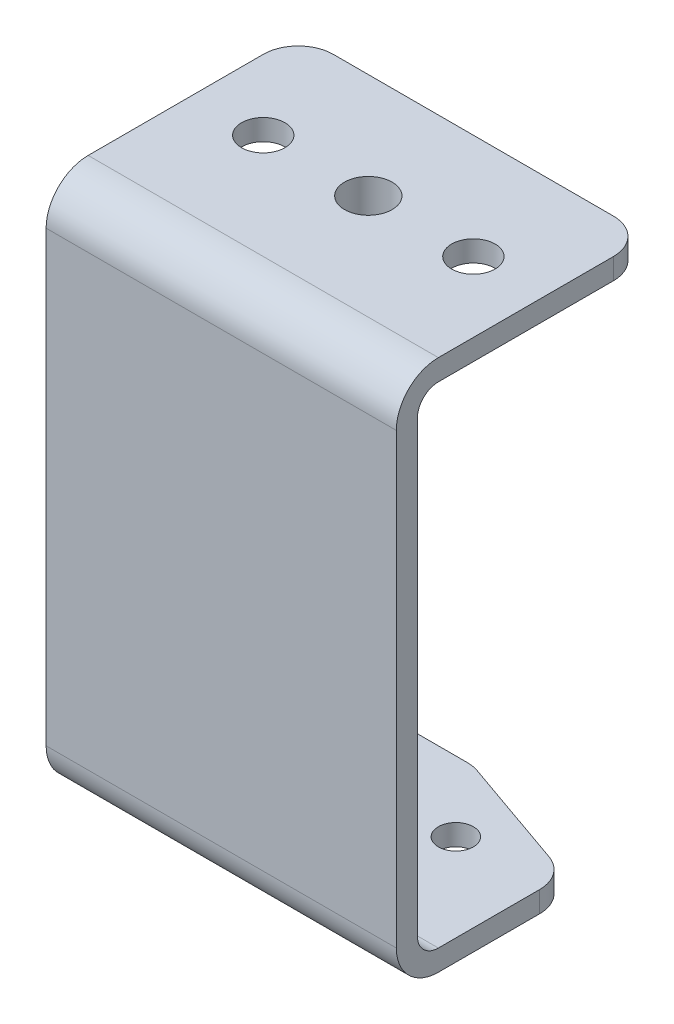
ISO-10303-21;
HEADER;
FILE_DESCRIPTION(('STEP AP214'),'2;1');
FILE_NAME('part.step','',(''),(''),'','','');
FILE_SCHEMA(('AUTOMOTIVE_DESIGN { 1 0 10303 214 1 1 1 1 }'));
ENDSEC;
DATA;
#1=APPLICATION_CONTEXT('core data for automotive mechanical design processes');
#2=APPLICATION_PROTOCOL_DEFINITION('international standard','automotive_design',2000,#1);
#3=PRODUCT_CONTEXT('',#1,'mechanical');
#4=PRODUCT('Part','Part','',(#3));
#5=PRODUCT_RELATED_PRODUCT_CATEGORY('part','',(#4));
#6=PRODUCT_DEFINITION_FORMATION('','',#4);
#7=PRODUCT_DEFINITION_CONTEXT('part definition',#1,'design');
#8=PRODUCT_DEFINITION('design','',#6,#7);
#9=PRODUCT_DEFINITION_SHAPE('','',#8);
#10=(LENGTH_UNIT() NAMED_UNIT(*) SI_UNIT(.MILLI.,.METRE.));
#11=(NAMED_UNIT(*) PLANE_ANGLE_UNIT() SI_UNIT($,.RADIAN.));
#12=(NAMED_UNIT(*) SI_UNIT($,.STERADIAN.) SOLID_ANGLE_UNIT());
#13=UNCERTAINTY_MEASURE_WITH_UNIT(LENGTH_MEASURE(1.E-05),#10,'distance_accuracy_value','');
#14=(GEOMETRIC_REPRESENTATION_CONTEXT(3) GLOBAL_UNCERTAINTY_ASSIGNED_CONTEXT((#13)) GLOBAL_UNIT_ASSIGNED_CONTEXT((#10,
#11,#12)) REPRESENTATION_CONTEXT('',''));
#15=CARTESIAN_POINT('',(0.,0.,0.));
#16=DIRECTION('',(0.,0.,1.));
#17=DIRECTION('',(1.,0.,0.));
#18=AXIS2_PLACEMENT_3D('',#15,#16,#17);
#19=CARTESIAN_POINT('',(24.9999999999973,138.,525.));
#20=DIRECTION('',(0.,-1.,0.));
#21=DIRECTION('',(0.,0.,-1.));
#22=AXIS2_PLACEMENT_3D('',#19,#20,#21);
#23=CYLINDRICAL_SURFACE('',#22,6.);
#24=CARTESIAN_POINT('',(24.9999999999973,138.,525.));
#25=DIRECTION('',(0.,-1.,0.));
#26=DIRECTION('',(0.,0.,-1.));
#27=AXIS2_PLACEMENT_3D('',#24,#25,#26);
#28=CIRCLE('',#27,6.);
#29=CARTESIAN_POINT('',(24.9999999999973,138.,519.));
#30=VERTEX_POINT('',#29);
#31=EDGE_CURVE('E317',#30,#30,#28,.F.);
#32=ORIENTED_EDGE('',*,*,#31,.F.);
#33=EDGE_LOOP('',(#32));
#34=FACE_BOUND('',#33,.T.);
#35=CARTESIAN_POINT('',(24.9999999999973,134.,525.));
#36=DIRECTION('',(0.,-1.,0.));
#37=DIRECTION('',(0.,0.,-1.));
#38=AXIS2_PLACEMENT_3D('',#35,#36,#37);
#39=CIRCLE('',#38,6.);
#40=CARTESIAN_POINT('',(24.9999999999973,134.,519.));
#41=VERTEX_POINT('',#40);
#42=EDGE_CURVE('E324',#41,#41,#39,.T.);
#43=ORIENTED_EDGE('',*,*,#42,.F.);
#44=EDGE_LOOP('',(#43));
#45=FACE_BOUND('',#44,.T.);
#46=ADVANCED_FACE('F17',(#34,#45),#23,.T.);
#47=CARTESIAN_POINT('',(20.8497286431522,68.,520.));
#48=DIRECTION('',(0.,-1.,0.));
#49=DIRECTION('',(0.,0.,-1.));
#50=AXIS2_PLACEMENT_3D('',#47,#48,#49);
#51=CYLINDRICAL_SURFACE('',#50,5.);
#52=CARTESIAN_POINT('',(20.8497286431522,68.,520.));
#53=DIRECTION('',(0.,-1.,0.));
#54=DIRECTION('',(0.,0.,-1.));
#55=AXIS2_PLACEMENT_3D('',#52,#53,#54);
#56=CIRCLE('',#55,5.);
#57=CARTESIAN_POINT('',(19.1979765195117,68.,515.28070821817));
#58=VERTEX_POINT('',#57);
#59=CARTESIAN_POINT('',(20.8497286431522,68.,515.));
#60=VERTEX_POINT('',#59);
#61=EDGE_CURVE('E322',#58,#60,#56,.T.);
#62=ORIENTED_EDGE('',*,*,#61,.T.);
#63=DIRECTION('',(0.,1.,0.));
#64=VECTOR('',#63,1.);
#65=CARTESIAN_POINT('',(20.8497286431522,68.,515.));
#66=LINE('',#65,#64);
#67=CARTESIAN_POINT('',(20.8497286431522,65.,515.));
#68=VERTEX_POINT('',#67);
#69=EDGE_CURVE('E159',#68,#60,#66,.T.);
#70=ORIENTED_EDGE('',*,*,#69,.F.);
#71=CARTESIAN_POINT('',(20.8497286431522,65.,520.));
#72=DIRECTION('',(0.,-1.,0.));
#73=DIRECTION('',(0.,0.,-1.));
#74=AXIS2_PLACEMENT_3D('',#71,#72,#73);
#75=CIRCLE('',#74,5.);
#76=CARTESIAN_POINT('',(19.1979765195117,65.,515.28070821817));
#77=VERTEX_POINT('',#76);
#78=EDGE_CURVE('E20',#68,#77,#75,.F.);
#79=ORIENTED_EDGE('',*,*,#78,.T.);
#80=DIRECTION('',(0.,1.,0.));
#81=VECTOR('',#80,1.);
#82=CARTESIAN_POINT('',(19.1979765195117,68.,515.28070821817));
#83=LINE('',#82,#81);
#84=EDGE_CURVE('E156',#77,#58,#83,.T.);
#85=ORIENTED_EDGE('',*,*,#84,.T.);
#86=EDGE_LOOP('',(#62,#70,#79,#85));
#87=FACE_BOUND('',#86,.T.);
#88=ADVANCED_FACE('F155',(#87),#51,.T.);
#89=CARTESIAN_POINT('',(29.1502713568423,68.,520.));
#90=DIRECTION('',(0.,1.,0.));
#91=DIRECTION('',(0.,0.,1.));
#92=AXIS2_PLACEMENT_3D('',#89,#90,#91);
#93=CYLINDRICAL_SURFACE('',#92,5.);
#94=CARTESIAN_POINT('',(29.1502713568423,65.,520.));
#95=DIRECTION('',(0.,1.,0.));
#96=DIRECTION('',(0.,0.,1.));
#97=AXIS2_PLACEMENT_3D('',#94,#95,#96);
#98=CIRCLE('',#97,5.);
#99=CARTESIAN_POINT('',(30.8020234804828,65.,515.28070821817));
#100=VERTEX_POINT('',#99);
#101=CARTESIAN_POINT('',(29.1502713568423,65.,515.));
#102=VERTEX_POINT('',#101);
#103=EDGE_CURVE('E161',#100,#102,#98,.T.);
#104=ORIENTED_EDGE('',*,*,#103,.T.);
#105=DIRECTION('',(0.,1.,0.));
#106=VECTOR('',#105,1.);
#107=CARTESIAN_POINT('',(29.1502713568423,68.,515.));
#108=LINE('',#107,#106);
#109=CARTESIAN_POINT('',(29.1502713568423,68.,515.));
#110=VERTEX_POINT('',#109);
#111=EDGE_CURVE('E236',#110,#102,#108,.F.);
#112=ORIENTED_EDGE('',*,*,#111,.F.);
#113=CARTESIAN_POINT('',(29.1502713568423,68.,520.));
#114=DIRECTION('',(0.,1.,0.));
#115=DIRECTION('',(0.,0.,1.));
#116=AXIS2_PLACEMENT_3D('',#113,#114,#115);
#117=CIRCLE('',#116,5.);
#118=CARTESIAN_POINT('',(30.8020234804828,68.,515.28070821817));
#119=VERTEX_POINT('',#118);
#120=EDGE_CURVE('E320',#110,#119,#117,.F.);
#121=ORIENTED_EDGE('',*,*,#120,.T.);
#122=DIRECTION('',(0.,1.,0.));
#123=VECTOR('',#122,1.);
#124=CARTESIAN_POINT('',(30.8020234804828,68.,515.28070821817));
#125=LINE('',#124,#123);
#126=EDGE_CURVE('E229',#119,#100,#125,.F.);
#127=ORIENTED_EDGE('',*,*,#126,.T.);
#128=EDGE_LOOP('',(#104,#112,#121,#127));
#129=FACE_BOUND('',#128,.T.);
#130=ADVANCED_FACE('F328',(#129),#93,.T.);
#131=CARTESIAN_POINT('',(24.9999999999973,134.,525.));
#132=DIRECTION('',(0.,-1.,0.));
#133=DIRECTION('',(0.,0.,-1.));
#134=AXIS2_PLACEMENT_3D('',#131,#132,#133);
#135=PLANE('',#134);
#136=ORIENTED_EDGE('',*,*,#42,.T.);
#137=EDGE_LOOP('',(#136));
#138=FACE_BOUND('',#137,.T.);
#139=CARTESIAN_POINT('',(24.9999999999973,134.,525.));
#140=DIRECTION('',(0.,1.,0.));
#141=DIRECTION('',(0.,0.,1.));
#142=AXIS2_PLACEMENT_3D('',#139,#140,#141);
#143=CIRCLE('',#142,3.4);
#144=CARTESIAN_POINT('',(24.9999999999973,134.,528.4));
#145=VERTEX_POINT('',#144);
#146=EDGE_CURVE('E217',#145,#145,#143,.T.);
#147=ORIENTED_EDGE('',*,*,#146,.T.);
#148=EDGE_LOOP('',(#147));
#149=FACE_BOUND('',#148,.T.);
#150=ADVANCED_FACE('F483',(#138,#149),#135,.T.);
#151=CARTESIAN_POINT('',(-2.74780198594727E-12,68.,540.));
#152=DIRECTION('',(0.,-1.,0.));
#153=DIRECTION('',(0.,0.,-1.));
#154=AXIS2_PLACEMENT_3D('',#151,#152,#153);
#155=PLANE('',#154);
#156=CARTESIAN_POINT('',(4.99999999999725,68.,525.547405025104));
#157=DIRECTION('',(0.,1.,0.));
#158=DIRECTION('',(0.,0.,1.));
#159=AXIS2_PLACEMENT_3D('',#156,#157,#158);
#160=CIRCLE('',#159,5.);
#161=CARTESIAN_POINT('',(-2.75384630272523E-12,68.,525.547405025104));
#162=VERTEX_POINT('',#161);
#163=CARTESIAN_POINT('',(3.34824787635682,68.,520.828113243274));
#164=VERTEX_POINT('',#163);
#165=EDGE_CURVE('E170',#162,#164,#160,.F.);
#166=ORIENTED_EDGE('',*,*,#165,.F.);
#167=DIRECTION('',(0.,0.,1.));
#168=VECTOR('',#167,1.);
#169=CARTESIAN_POINT('',(-2.74780198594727E-12,68.,540.));
#170=LINE('',#169,#168);
#171=CARTESIAN_POINT('',(-2.74780198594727E-12,68.,540.));
#172=VERTEX_POINT('',#171);
#173=EDGE_CURVE('E196',#172,#162,#170,.F.);
#174=ORIENTED_EDGE('',*,*,#173,.F.);
#175=DIRECTION('',(-1.,0.,0.));
#176=VECTOR('',#175,1.);
#177=CARTESIAN_POINT('',(-2.74780198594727E-12,68.,540.));
#178=LINE('',#177,#176);
#179=CARTESIAN_POINT('',(49.9999999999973,68.,540.));
#180=VERTEX_POINT('',#179);
#181=EDGE_CURVE('E190',#172,#180,#178,.F.);
#182=ORIENTED_EDGE('',*,*,#181,.T.);
#183=DIRECTION('',(0.,0.,-1.));
#184=VECTOR('',#183,1.);
#185=CARTESIAN_POINT('',(49.9999999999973,68.,515.));
#186=LINE('',#185,#184);
#187=CARTESIAN_POINT('',(49.9999999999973,68.,525.547405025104));
#188=VERTEX_POINT('',#187);
#189=EDGE_CURVE('E218',#188,#180,#186,.F.);
#190=ORIENTED_EDGE('',*,*,#189,.F.);
#191=CARTESIAN_POINT('',(44.9999999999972,68.,525.547405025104));
#192=DIRECTION('',(0.,-1.,0.));
#193=DIRECTION('',(0.,0.,-1.));
#194=AXIS2_PLACEMENT_3D('',#191,#192,#193);
#195=CIRCLE('',#194,5.);
#196=CARTESIAN_POINT('',(46.6517521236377,68.,520.828113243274));
#197=VERTEX_POINT('',#196);
#198=EDGE_CURVE('E225',#197,#188,#195,.T.);
#199=ORIENTED_EDGE('',*,*,#198,.F.);
#200=DIRECTION('',(0.943858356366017,0.,0.330350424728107));
#201=VECTOR('',#200,1.);
#202=CARTESIAN_POINT('',(29.9999999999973,68.,515.));
#203=LINE('',#202,#201);
#204=EDGE_CURVE('E232',#197,#119,#203,.F.);
#205=ORIENTED_EDGE('',*,*,#204,.T.);
#206=ORIENTED_EDGE('',*,*,#120,.F.);
#207=DIRECTION('',(-1.,0.,0.));
#208=VECTOR('',#207,1.);
#209=CARTESIAN_POINT('',(-2.74780198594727E-12,68.,515.));
#210=LINE('',#209,#208);
#211=EDGE_CURVE('E234',#60,#110,#210,.F.);
#212=ORIENTED_EDGE('',*,*,#211,.F.);
#213=ORIENTED_EDGE('',*,*,#61,.F.);
#214=DIRECTION('',(0.943858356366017,0.,-0.330350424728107));
#215=VECTOR('',#214,1.);
#216=CARTESIAN_POINT('',(-2.74780198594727E-12,68.,522.));
#217=LINE('',#216,#215);
#218=EDGE_CURVE('E169',#58,#164,#217,.F.);
#219=ORIENTED_EDGE('',*,*,#218,.T.);
#220=EDGE_LOOP('',(#166,#174,#182,#190,#199,#205,#206,#212,#213,#219));
#221=FACE_BOUND('',#220,.T.);
#222=CARTESIAN_POINT('',(37.4999999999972,68.,525.));
#223=DIRECTION('',(0.,-1.,0.));
#224=DIRECTION('',(0.,0.,-1.));
#225=AXIS2_PLACEMENT_3D('',#222,#223,#224);
#226=CIRCLE('',#225,2.5);
#227=CARTESIAN_POINT('',(37.4999999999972,68.,522.5));
#228=VERTEX_POINT('',#227);
#229=EDGE_CURVE('E311',#228,#228,#226,.T.);
#230=ORIENTED_EDGE('',*,*,#229,.T.);
#231=EDGE_LOOP('',(#230));
#232=FACE_BOUND('',#231,.T.);
#233=CARTESIAN_POINT('',(12.4999999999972,68.,525.));
#234=DIRECTION('',(0.,-1.,0.));
#235=DIRECTION('',(0.,0.,-1.));
#236=AXIS2_PLACEMENT_3D('',#233,#234,#235);
#237=CIRCLE('',#236,2.5);
#238=CARTESIAN_POINT('',(12.4999999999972,68.,522.5));
#239=VERTEX_POINT('',#238);
#240=EDGE_CURVE('E314',#239,#239,#237,.T.);
#241=ORIENTED_EDGE('',*,*,#240,.T.);
#242=EDGE_LOOP('',(#241));
#243=FACE_BOUND('',#242,.T.);
#244=ADVANCED_FACE('F336',(#221,#232,#243),#155,.F.);
#245=CARTESIAN_POINT('',(-2.74780198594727E-12,138.,540.));
#246=DIRECTION('',(0.,-1.,0.));
#247=DIRECTION('',(0.,0.,-1.));
#248=AXIS2_PLACEMENT_3D('',#245,#246,#247);
#249=PLANE('',#248);
#250=DIRECTION('',(0.,0.,1.));
#251=VECTOR('',#250,1.);
#252=CARTESIAN_POINT('',(-2.74780198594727E-12,138.,540.));
#253=LINE('',#252,#251);
#254=CARTESIAN_POINT('',(-2.74780198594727E-12,138.,515.));
#255=VERTEX_POINT('',#254);
#256=CARTESIAN_POINT('',(-2.74780198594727E-12,138.,540.));
#257=VERTEX_POINT('',#256);
#258=EDGE_CURVE('E191',#255,#257,#253,.T.);
#259=ORIENTED_EDGE('',*,*,#258,.F.);
#260=CARTESIAN_POINT('',(4.99999999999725,138.,515.));
#261=DIRECTION('',(0.,-1.,0.));
#262=DIRECTION('',(0.,0.,-1.));
#263=AXIS2_PLACEMENT_3D('',#260,#261,#262);
#264=CIRCLE('',#263,5.);
#265=CARTESIAN_POINT('',(4.99999999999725,138.,510.));
#266=VERTEX_POINT('',#265);
#267=EDGE_CURVE('E200',#266,#255,#264,.F.);
#268=ORIENTED_EDGE('',*,*,#267,.F.);
#269=DIRECTION('',(-1.,0.,0.));
#270=VECTOR('',#269,1.);
#271=CARTESIAN_POINT('',(49.9999999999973,138.,510.));
#272=LINE('',#271,#270);
#273=CARTESIAN_POINT('',(44.9999999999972,138.,510.));
#274=VERTEX_POINT('',#273);
#275=EDGE_CURVE('E206',#274,#266,#272,.T.);
#276=ORIENTED_EDGE('',*,*,#275,.F.);
#277=CARTESIAN_POINT('',(44.9999999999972,138.,515.));
#278=DIRECTION('',(0.,1.,0.));
#279=DIRECTION('',(0.,0.,1.));
#280=AXIS2_PLACEMENT_3D('',#277,#278,#279);
#281=CIRCLE('',#280,5.);
#282=CARTESIAN_POINT('',(49.9999999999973,138.,515.));
#283=VERTEX_POINT('',#282);
#284=EDGE_CURVE('E213',#283,#274,#281,.T.);
#285=ORIENTED_EDGE('',*,*,#284,.F.);
#286=DIRECTION('',(0.,0.,-1.));
#287=VECTOR('',#286,1.);
#288=CARTESIAN_POINT('',(49.9999999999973,138.,540.));
#289=LINE('',#288,#287);
#290=CARTESIAN_POINT('',(49.9999999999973,138.,540.));
#291=VERTEX_POINT('',#290);
#292=EDGE_CURVE('E214',#291,#283,#289,.T.);
#293=ORIENTED_EDGE('',*,*,#292,.F.);
#294=DIRECTION('',(-1.,0.,0.));
#295=VECTOR('',#294,1.);
#296=CARTESIAN_POINT('',(-2.74780198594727E-12,138.,540.));
#297=LINE('',#296,#295);
#298=EDGE_CURVE('E187',#291,#257,#297,.T.);
#299=ORIENTED_EDGE('',*,*,#298,.T.);
#300=EDGE_LOOP('',(#259,#268,#276,#285,#293,#299));
#301=FACE_BOUND('',#300,.T.);
#302=ORIENTED_EDGE('',*,*,#31,.T.);
#303=EDGE_LOOP('',(#302));
#304=FACE_BOUND('',#303,.T.);
#305=CARTESIAN_POINT('',(39.9999999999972,138.,525.));
#306=DIRECTION('',(0.,-1.,0.));
#307=DIRECTION('',(0.,0.,-1.));
#308=AXIS2_PLACEMENT_3D('',#305,#306,#307);
#309=CIRCLE('',#308,3.1);
#310=CARTESIAN_POINT('',(39.9999999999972,138.,521.9));
#311=VERTEX_POINT('',#310);
#312=EDGE_CURVE('E303',#311,#311,#309,.F.);
#313=ORIENTED_EDGE('',*,*,#312,.T.);
#314=EDGE_LOOP('',(#313));
#315=FACE_BOUND('',#314,.T.);
#316=CARTESIAN_POINT('',(9.99999999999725,138.,525.));
#317=DIRECTION('',(0.,-1.,0.));
#318=DIRECTION('',(0.,0.,-1.));
#319=AXIS2_PLACEMENT_3D('',#316,#317,#318);
#320=CIRCLE('',#319,3.1);
#321=CARTESIAN_POINT('',(9.99999999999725,138.,521.9));
#322=VERTEX_POINT('',#321);
#323=EDGE_CURVE('E221',#322,#322,#320,.F.);
#324=ORIENTED_EDGE('',*,*,#323,.T.);
#325=EDGE_LOOP('',(#324));
#326=FACE_BOUND('',#325,.T.);
#327=ADVANCED_FACE('F416',(#301,#304,#315,#326),#249,.T.);
#328=CARTESIAN_POINT('',(12.4999999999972,68.,525.));
#329=DIRECTION('',(0.,-1.,0.));
#330=DIRECTION('',(0.,0.,-1.));
#331=AXIS2_PLACEMENT_3D('',#328,#329,#330);
#332=CYLINDRICAL_SURFACE('',#331,2.5);
#333=ORIENTED_EDGE('',*,*,#240,.F.);
#334=EDGE_LOOP('',(#333));
#335=FACE_BOUND('',#334,.T.);
#336=CARTESIAN_POINT('',(12.4999999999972,65.,525.));
#337=DIRECTION('',(0.,-1.,0.));
#338=DIRECTION('',(0.,0.,-1.));
#339=AXIS2_PLACEMENT_3D('',#336,#337,#338);
#340=CIRCLE('',#339,2.5);
#341=CARTESIAN_POINT('',(12.4999999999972,65.,522.5));
#342=VERTEX_POINT('',#341);
#343=EDGE_CURVE('E189',#342,#342,#340,.F.);
#344=ORIENTED_EDGE('',*,*,#343,.F.);
#345=EDGE_LOOP('',(#344));
#346=FACE_BOUND('',#345,.T.);
#347=ADVANCED_FACE('F419',(#335,#346),#332,.F.);
#348=CARTESIAN_POINT('',(37.4999999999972,68.,525.));
#349=DIRECTION('',(0.,-1.,0.));
#350=DIRECTION('',(0.,0.,-1.));
#351=AXIS2_PLACEMENT_3D('',#348,#349,#350);
#352=CYLINDRICAL_SURFACE('',#351,2.5);
#353=ORIENTED_EDGE('',*,*,#229,.F.);
#354=EDGE_LOOP('',(#353));
#355=FACE_BOUND('',#354,.T.);
#356=CARTESIAN_POINT('',(37.4999999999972,65.,525.));
#357=DIRECTION('',(0.,-1.,0.));
#358=DIRECTION('',(0.,0.,-1.));
#359=AXIS2_PLACEMENT_3D('',#356,#357,#358);
#360=CIRCLE('',#359,2.5);
#361=CARTESIAN_POINT('',(37.4999999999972,65.,522.5));
#362=VERTEX_POINT('',#361);
#363=EDGE_CURVE('E186',#362,#362,#360,.F.);
#364=ORIENTED_EDGE('',*,*,#363,.F.);
#365=EDGE_LOOP('',(#364));
#366=FACE_BOUND('',#365,.T.);
#367=ADVANCED_FACE('F542',(#355,#366),#352,.F.);
#368=CARTESIAN_POINT('',(4.99999999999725,68.,525.547405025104));
#369=DIRECTION('',(0.,1.,0.));
#370=DIRECTION('',(0.,0.,1.));
#371=AXIS2_PLACEMENT_3D('',#368,#369,#370);
#372=CYLINDRICAL_SURFACE('',#371,5.);
#373=CARTESIAN_POINT('',(4.99999999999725,65.,525.547405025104));
#374=DIRECTION('',(0.,1.,0.));
#375=DIRECTION('',(0.,0.,1.));
#376=AXIS2_PLACEMENT_3D('',#373,#374,#375);
#377=CIRCLE('',#376,5.);
#378=CARTESIAN_POINT('',(-2.75083775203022E-12,65.,525.547405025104));
#379=VERTEX_POINT('',#378);
#380=CARTESIAN_POINT('',(3.34824787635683,65.,520.828113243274));
#381=VERTEX_POINT('',#380);
#382=EDGE_CURVE('E176',#379,#381,#377,.F.);
#383=ORIENTED_EDGE('',*,*,#382,.F.);
#384=DIRECTION('',(0.,1.,0.));
#385=VECTOR('',#384,1.);
#386=CARTESIAN_POINT('',(-2.75381908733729E-12,68.,525.547405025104));
#387=LINE('',#386,#385);
#388=EDGE_CURVE('E199',#162,#379,#387,.F.);
#389=ORIENTED_EDGE('',*,*,#388,.F.);
#390=ORIENTED_EDGE('',*,*,#165,.T.);
#391=DIRECTION('',(0.,1.,0.));
#392=VECTOR('',#391,1.);
#393=CARTESIAN_POINT('',(3.34824787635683,68.,520.828113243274));
#394=LINE('',#393,#392);
#395=EDGE_CURVE('E235',#164,#381,#394,.F.);
#396=ORIENTED_EDGE('',*,*,#395,.T.);
#397=EDGE_LOOP('',(#383,#389,#390,#396));
#398=FACE_BOUND('',#397,.T.);
#399=ADVANCED_FACE('F552',(#398),#372,.T.);
#400=CARTESIAN_POINT('',(-2.74780198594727E-12,68.,522.));
#401=DIRECTION('',(0.330350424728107,0.,0.943858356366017));
#402=DIRECTION('',(0.943858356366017,0.,-0.330350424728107));
#403=AXIS2_PLACEMENT_3D('',#400,#401,#402);
#404=PLANE('',#403);
#405=ORIENTED_EDGE('',*,*,#395,.F.);
#406=ORIENTED_EDGE('',*,*,#218,.F.);
#407=ORIENTED_EDGE('',*,*,#84,.F.);
#408=DIRECTION('',(0.943858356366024,0.,-0.330350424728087));
#409=VECTOR('',#408,1.);
#410=CARTESIAN_POINT('',(3.34824787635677,65.,520.828113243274));
#411=LINE('',#410,#409);
#412=EDGE_CURVE('E167',#381,#77,#411,.T.);
#413=ORIENTED_EDGE('',*,*,#412,.F.);
#414=EDGE_LOOP('',(#405,#406,#407,#413));
#415=FACE_BOUND('',#414,.T.);
#416=ADVANCED_FACE('F166',(#415),#404,.F.);
#417=CARTESIAN_POINT('',(-2.74780198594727E-12,68.,515.));
#418=DIRECTION('',(0.,0.,-1.));
#419=DIRECTION('',(-1.,0.,0.));
#420=AXIS2_PLACEMENT_3D('',#417,#418,#419);
#421=PLANE('',#420);
#422=ORIENTED_EDGE('',*,*,#211,.T.);
#423=ORIENTED_EDGE('',*,*,#111,.T.);
#424=DIRECTION('',(1.,0.,0.));
#425=VECTOR('',#424,1.);
#426=CARTESIAN_POINT('',(-2.74780198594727E-12,65.,515.));
#427=LINE('',#426,#425);
#428=EDGE_CURVE('E177',#68,#102,#427,.T.);
#429=ORIENTED_EDGE('',*,*,#428,.F.);
#430=ORIENTED_EDGE('',*,*,#69,.T.);
#431=EDGE_LOOP('',(#422,#423,#429,#430));
#432=FACE_BOUND('',#431,.T.);
#433=ADVANCED_FACE('F333',(#432),#421,.T.);
#434=CARTESIAN_POINT('',(29.9999999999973,68.,515.));
#435=DIRECTION('',(-0.330350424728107,0.,0.943858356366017));
#436=DIRECTION('',(0.943858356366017,0.,0.330350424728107));
#437=AXIS2_PLACEMENT_3D('',#434,#435,#436);
#438=PLANE('',#437);
#439=ORIENTED_EDGE('',*,*,#126,.F.);
#440=ORIENTED_EDGE('',*,*,#204,.F.);
#441=DIRECTION('',(0.,-1.,0.));
#442=VECTOR('',#441,1.);
#443=CARTESIAN_POINT('',(46.6517521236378,68.,520.828113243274));
#444=LINE('',#443,#442);
#445=CARTESIAN_POINT('',(46.6517521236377,65.,520.828113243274));
#446=VERTEX_POINT('',#445);
#447=EDGE_CURVE('E226',#446,#197,#444,.F.);
#448=ORIENTED_EDGE('',*,*,#447,.F.);
#449=DIRECTION('',(0.943858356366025,0.,0.330350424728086));
#450=VECTOR('',#449,1.);
#451=CARTESIAN_POINT('',(30.8020234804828,65.,515.28070821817));
#452=LINE('',#451,#450);
#453=EDGE_CURVE('E179',#100,#446,#452,.T.);
#454=ORIENTED_EDGE('',*,*,#453,.F.);
#455=EDGE_LOOP('',(#439,#440,#448,#454));
#456=FACE_BOUND('',#455,.T.);
#457=ADVANCED_FACE('F341',(#456),#438,.F.);
#458=CARTESIAN_POINT('',(44.9999999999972,68.,525.547405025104));
#459=DIRECTION('',(0.,-1.,0.));
#460=DIRECTION('',(0.,0.,-1.));
#461=AXIS2_PLACEMENT_3D('',#458,#459,#460);
#462=CYLINDRICAL_SURFACE('',#461,5.);
#463=ORIENTED_EDGE('',*,*,#198,.T.);
#464=DIRECTION('',(0.,1.,0.));
#465=VECTOR('',#464,1.);
#466=CARTESIAN_POINT('',(49.9999999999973,68.,525.547405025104));
#467=LINE('',#466,#465);
#468=CARTESIAN_POINT('',(49.9999999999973,65.,525.547405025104));
#469=VERTEX_POINT('',#468);
#470=EDGE_CURVE('E222',#469,#188,#467,.T.);
#471=ORIENTED_EDGE('',*,*,#470,.F.);
#472=CARTESIAN_POINT('',(44.9999999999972,65.,525.547405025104));
#473=DIRECTION('',(0.,-1.,0.));
#474=DIRECTION('',(0.,0.,-1.));
#475=AXIS2_PLACEMENT_3D('',#472,#473,#474);
#476=CIRCLE('',#475,5.);
#477=EDGE_CURVE('E292',#446,#469,#476,.T.);
#478=ORIENTED_EDGE('',*,*,#477,.F.);
#479=ORIENTED_EDGE('',*,*,#447,.T.);
#480=EDGE_LOOP('',(#463,#471,#478,#479));
#481=FACE_BOUND('',#480,.T.);
#482=ADVANCED_FACE('F392',(#481),#462,.T.);
#483=CARTESIAN_POINT('',(9.99999999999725,141.,525.));
#484=DIRECTION('',(0.,-1.,0.));
#485=DIRECTION('',(0.,0.,-1.));
#486=AXIS2_PLACEMENT_3D('',#483,#484,#485);
#487=CYLINDRICAL_SURFACE('',#486,3.1);
#488=CARTESIAN_POINT('',(9.99999999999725,141.,525.));
#489=DIRECTION('',(0.,-1.,0.));
#490=DIRECTION('',(0.,0.,-1.));
#491=AXIS2_PLACEMENT_3D('',#488,#489,#490);
#492=CIRCLE('',#491,3.1);
#493=CARTESIAN_POINT('',(9.99999999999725,141.,521.9));
#494=VERTEX_POINT('',#493);
#495=EDGE_CURVE('E282',#494,#494,#492,.T.);
#496=ORIENTED_EDGE('',*,*,#495,.F.);
#497=EDGE_LOOP('',(#496));
#498=FACE_BOUND('',#497,.T.);
#499=ORIENTED_EDGE('',*,*,#323,.F.);
#500=EDGE_LOOP('',(#499));
#501=FACE_BOUND('',#500,.T.);
#502=ADVANCED_FACE('F427',(#498,#501),#487,.F.);
#503=CARTESIAN_POINT('',(39.9999999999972,141.,525.));
#504=DIRECTION('',(0.,-1.,0.));
#505=DIRECTION('',(0.,0.,-1.));
#506=AXIS2_PLACEMENT_3D('',#503,#504,#505);
#507=CYLINDRICAL_SURFACE('',#506,3.1);
#508=CARTESIAN_POINT('',(39.9999999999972,141.,525.));
#509=DIRECTION('',(0.,-1.,0.));
#510=DIRECTION('',(0.,0.,-1.));
#511=AXIS2_PLACEMENT_3D('',#508,#509,#510);
#512=CIRCLE('',#511,3.1);
#513=CARTESIAN_POINT('',(39.9999999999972,141.,521.9));
#514=VERTEX_POINT('',#513);
#515=EDGE_CURVE('E279',#514,#514,#512,.T.);
#516=ORIENTED_EDGE('',*,*,#515,.F.);
#517=EDGE_LOOP('',(#516));
#518=FACE_BOUND('',#517,.T.);
#519=ORIENTED_EDGE('',*,*,#312,.F.);
#520=EDGE_LOOP('',(#519));
#521=FACE_BOUND('',#520,.T.);
#522=ADVANCED_FACE('F429',(#518,#521),#507,.F.);
#523=CARTESIAN_POINT('',(24.9999999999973,134.,525.));
#524=DIRECTION('',(0.,1.,0.));
#525=DIRECTION('',(0.,0.,1.));
#526=AXIS2_PLACEMENT_3D('',#523,#524,#525);
#527=CYLINDRICAL_SURFACE('',#526,3.4);
#528=ORIENTED_EDGE('',*,*,#146,.F.);
#529=EDGE_LOOP('',(#528));
#530=FACE_BOUND('',#529,.T.);
#531=CARTESIAN_POINT('',(24.9999999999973,141.,525.));
#532=DIRECTION('',(0.,1.,0.));
#533=DIRECTION('',(0.,0.,1.));
#534=AXIS2_PLACEMENT_3D('',#531,#532,#533);
#535=CIRCLE('',#534,3.4);
#536=CARTESIAN_POINT('',(24.9999999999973,141.,528.4));
#537=VERTEX_POINT('',#536);
#538=EDGE_CURVE('E276',#537,#537,#535,.F.);
#539=ORIENTED_EDGE('',*,*,#538,.F.);
#540=EDGE_LOOP('',(#539));
#541=FACE_BOUND('',#540,.T.);
#542=ADVANCED_FACE('F437',(#530,#541),#527,.F.);
#543=CARTESIAN_POINT('',(44.9999999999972,138.,515.));
#544=DIRECTION('',(0.,1.,0.));
#545=DIRECTION('',(0.,0.,1.));
#546=AXIS2_PLACEMENT_3D('',#543,#544,#545);
#547=CYLINDRICAL_SURFACE('',#546,5.);
#548=CARTESIAN_POINT('',(44.9999999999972,141.,515.));
#549=DIRECTION('',(0.,1.,0.));
#550=DIRECTION('',(0.,0.,1.));
#551=AXIS2_PLACEMENT_3D('',#548,#549,#550);
#552=CIRCLE('',#551,5.);
#553=CARTESIAN_POINT('',(49.9999999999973,141.,515.));
#554=VERTEX_POINT('',#553);
#555=CARTESIAN_POINT('',(44.9999999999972,141.,510.));
#556=VERTEX_POINT('',#555);
#557=EDGE_CURVE('E272',#554,#556,#552,.T.);
#558=ORIENTED_EDGE('',*,*,#557,.F.);
#559=DIRECTION('',(0.,1.,0.));
#560=VECTOR('',#559,1.);
#561=CARTESIAN_POINT('',(49.9999999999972,138.,515.));
#562=LINE('',#561,#560);
#563=EDGE_CURVE('E210',#554,#283,#562,.F.);
#564=ORIENTED_EDGE('',*,*,#563,.T.);
#565=ORIENTED_EDGE('',*,*,#284,.T.);
#566=DIRECTION('',(0.,1.,0.));
#567=VECTOR('',#566,1.);
#568=CARTESIAN_POINT('',(44.9999999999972,138.,510.));
#569=LINE('',#568,#567);
#570=EDGE_CURVE('E207',#556,#274,#569,.F.);
#571=ORIENTED_EDGE('',*,*,#570,.F.);
#572=EDGE_LOOP('',(#558,#564,#565,#571));
#573=FACE_BOUND('',#572,.T.);
#574=ADVANCED_FACE('F408',(#573),#547,.T.);
#575=CARTESIAN_POINT('',(49.9999999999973,138.,510.));
#576=DIRECTION('',(0.,0.,-1.));
#577=DIRECTION('',(-1.,0.,0.));
#578=AXIS2_PLACEMENT_3D('',#575,#576,#577);
#579=PLANE('',#578);
#580=ORIENTED_EDGE('',*,*,#275,.T.);
#581=DIRECTION('',(0.,-1.,0.));
#582=VECTOR('',#581,1.);
#583=CARTESIAN_POINT('',(4.99999999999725,141.,510.));
#584=LINE('',#583,#582);
#585=CARTESIAN_POINT('',(4.99999999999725,141.,510.));
#586=VERTEX_POINT('',#585);
#587=EDGE_CURVE('E203',#586,#266,#584,.T.);
#588=ORIENTED_EDGE('',*,*,#587,.F.);
#589=DIRECTION('',(1.,0.,0.));
#590=VECTOR('',#589,1.);
#591=CARTESIAN_POINT('',(49.9999999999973,141.,510.));
#592=LINE('',#591,#590);
#593=EDGE_CURVE('E271',#556,#586,#592,.F.);
#594=ORIENTED_EDGE('',*,*,#593,.F.);
#595=ORIENTED_EDGE('',*,*,#570,.T.);
#596=EDGE_LOOP('',(#580,#588,#594,#595));
#597=FACE_BOUND('',#596,.T.);
#598=ADVANCED_FACE('F412',(#597),#579,.T.);
#599=CARTESIAN_POINT('',(4.99999999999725,141.,515.));
#600=DIRECTION('',(0.,-1.,0.));
#601=DIRECTION('',(0.,0.,-1.));
#602=AXIS2_PLACEMENT_3D('',#599,#600,#601);
#603=CYLINDRICAL_SURFACE('',#602,5.);
#604=ORIENTED_EDGE('',*,*,#267,.T.);
#605=DIRECTION('',(0.,1.,0.));
#606=VECTOR('',#605,1.);
#607=CARTESIAN_POINT('',(-2.74780198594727E-12,141.,515.));
#608=LINE('',#607,#606);
#609=CARTESIAN_POINT('',(-2.74780198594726E-12,141.,515.));
#610=VERTEX_POINT('',#609);
#611=EDGE_CURVE('E194',#610,#255,#608,.F.);
#612=ORIENTED_EDGE('',*,*,#611,.F.);
#613=CARTESIAN_POINT('',(4.99999999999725,141.,515.));
#614=DIRECTION('',(0.,-1.,0.));
#615=DIRECTION('',(0.,0.,-1.));
#616=AXIS2_PLACEMENT_3D('',#613,#614,#615);
#617=CIRCLE('',#616,5.);
#618=EDGE_CURVE('E268',#586,#610,#617,.F.);
#619=ORIENTED_EDGE('',*,*,#618,.F.);
#620=ORIENTED_EDGE('',*,*,#587,.T.);
#621=EDGE_LOOP('',(#604,#612,#619,#620));
#622=FACE_BOUND('',#621,.T.);
#623=ADVANCED_FACE('F415',(#622),#603,.T.);
#624=CARTESIAN_POINT('',(-2.74780198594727E-12,71.,540.));
#625=DIRECTION('',(-1.,0.,0.));
#626=DIRECTION('',(0.,0.,1.));
#627=AXIS2_PLACEMENT_3D('',#624,#625,#626);
#628=CYLINDRICAL_SURFACE('',#627,3.);
#629=CARTESIAN_POINT('',(-2.74780198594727E-12,71.,540.));
#630=DIRECTION('',(-1.,0.,0.));
#631=DIRECTION('',(0.,0.,1.));
#632=AXIS2_PLACEMENT_3D('',#629,#630,#631);
#633=CIRCLE('',#632,3.);
#634=CARTESIAN_POINT('',(-2.74780198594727E-12,71.,543.));
#635=VERTEX_POINT('',#634);
#636=EDGE_CURVE('E264',#635,#172,#633,.F.);
#637=ORIENTED_EDGE('',*,*,#636,.F.);
#638=DIRECTION('',(1.,0.,0.));
#639=VECTOR('',#638,1.);
#640=CARTESIAN_POINT('',(-2.74780198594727E-12,71.,543.));
#641=LINE('',#640,#639);
#642=CARTESIAN_POINT('',(49.9999999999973,71.,543.));
#643=VERTEX_POINT('',#642);
#644=EDGE_CURVE('E263',#643,#635,#641,.F.);
#645=ORIENTED_EDGE('',*,*,#644,.F.);
#646=CARTESIAN_POINT('',(49.9999999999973,71.,540.));
#647=DIRECTION('',(-1.,0.,0.));
#648=DIRECTION('',(0.,0.,1.));
#649=AXIS2_PLACEMENT_3D('',#646,#647,#648);
#650=CIRCLE('',#649,3.);
#651=EDGE_CURVE('E288',#180,#643,#650,.T.);
#652=ORIENTED_EDGE('',*,*,#651,.F.);
#653=ORIENTED_EDGE('',*,*,#181,.F.);
#654=EDGE_LOOP('',(#637,#645,#652,#653));
#655=FACE_BOUND('',#654,.T.);
#656=ADVANCED_FACE('F397',(#655),#628,.F.);
#657=CARTESIAN_POINT('',(-2.74780198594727E-12,135.,540.));
#658=DIRECTION('',(-1.,0.,0.));
#659=DIRECTION('',(0.,0.,1.));
#660=AXIS2_PLACEMENT_3D('',#657,#658,#659);
#661=CYLINDRICAL_SURFACE('',#660,3.);
#662=CARTESIAN_POINT('',(-2.74780198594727E-12,135.,540.));
#663=DIRECTION('',(-1.,0.,0.));
#664=DIRECTION('',(0.,0.,1.));
#665=AXIS2_PLACEMENT_3D('',#662,#663,#664);
#666=CIRCLE('',#665,3.);
#667=CARTESIAN_POINT('',(-2.74780198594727E-12,135.,543.));
#668=VERTEX_POINT('',#667);
#669=EDGE_CURVE('E260',#257,#668,#666,.F.);
#670=ORIENTED_EDGE('',*,*,#669,.F.);
#671=ORIENTED_EDGE('',*,*,#298,.F.);
#672=CARTESIAN_POINT('',(49.9999999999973,135.,540.));
#673=DIRECTION('',(-1.,0.,0.));
#674=DIRECTION('',(0.,0.,1.));
#675=AXIS2_PLACEMENT_3D('',#672,#673,#674);
#676=CIRCLE('',#675,3.);
#677=CARTESIAN_POINT('',(49.9999999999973,135.,543.));
#678=VERTEX_POINT('',#677);
#679=EDGE_CURVE('E285',#678,#291,#676,.T.);
#680=ORIENTED_EDGE('',*,*,#679,.F.);
#681=DIRECTION('',(1.,0.,0.));
#682=VECTOR('',#681,1.);
#683=CARTESIAN_POINT('',(-2.74780198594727E-12,135.,543.));
#684=LINE('',#683,#682);
#685=EDGE_CURVE('E347',#668,#678,#684,.T.);
#686=ORIENTED_EDGE('',*,*,#685,.F.);
#687=EDGE_LOOP('',(#670,#671,#680,#686));
#688=FACE_BOUND('',#687,.T.);
#689=ADVANCED_FACE('F405',(#688),#661,.F.);
#690=CARTESIAN_POINT('',(-2.74780198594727E-12,65.,540.));
#691=DIRECTION('',(0.,-1.,0.));
#692=DIRECTION('',(0.,0.,-1.));
#693=AXIS2_PLACEMENT_3D('',#690,#691,#692);
#694=PLANE('',#693);
#695=DIRECTION('',(0.,0.,-1.));
#696=VECTOR('',#695,1.);
#697=CARTESIAN_POINT('',(49.9999999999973,65.,540.));
#698=LINE('',#697,#696);
#699=CARTESIAN_POINT('',(49.9999999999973,65.,540.));
#700=VERTEX_POINT('',#699);
#701=EDGE_CURVE('E291',#469,#700,#698,.F.);
#702=ORIENTED_EDGE('',*,*,#701,.T.);
#703=DIRECTION('',(-1.,0.,0.));
#704=VECTOR('',#703,1.);
#705=CARTESIAN_POINT('',(-2.74780198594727E-12,65.,540.));
#706=LINE('',#705,#704);
#707=CARTESIAN_POINT('',(-2.74780198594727E-12,65.,540.));
#708=VERTEX_POINT('',#707);
#709=EDGE_CURVE('E259',#708,#700,#706,.F.);
#710=ORIENTED_EDGE('',*,*,#709,.F.);
#711=DIRECTION('',(0.,0.,-1.));
#712=VECTOR('',#711,1.);
#713=CARTESIAN_POINT('',(-2.74780198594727E-12,65.,540.));
#714=LINE('',#713,#712);
#715=EDGE_CURVE('E181',#708,#379,#714,.T.);
#716=ORIENTED_EDGE('',*,*,#715,.T.);
#717=ORIENTED_EDGE('',*,*,#382,.T.);
#718=ORIENTED_EDGE('',*,*,#412,.T.);
#719=ORIENTED_EDGE('',*,*,#78,.F.);
#720=ORIENTED_EDGE('',*,*,#428,.T.);
#721=ORIENTED_EDGE('',*,*,#103,.F.);
#722=ORIENTED_EDGE('',*,*,#453,.T.);
#723=ORIENTED_EDGE('',*,*,#477,.T.);
#724=EDGE_LOOP('',(#702,#710,#716,#717,#718,#719,#720,#721,#722,#723));
#725=FACE_BOUND('',#724,.T.);
#726=ORIENTED_EDGE('',*,*,#363,.T.);
#727=EDGE_LOOP('',(#726));
#728=FACE_BOUND('',#727,.T.);
#729=ORIENTED_EDGE('',*,*,#343,.T.);
#730=EDGE_LOOP('',(#729));
#731=FACE_BOUND('',#730,.T.);
#732=ADVANCED_FACE('F172',(#725,#728,#731),#694,.T.);
#733=CARTESIAN_POINT('',(49.9999999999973,141.,540.));
#734=DIRECTION('',(0.,1.,0.));
#735=DIRECTION('',(0.,0.,1.));
#736=AXIS2_PLACEMENT_3D('',#733,#734,#735);
#737=PLANE('',#736);
#738=DIRECTION('',(0.,0.,1.));
#739=VECTOR('',#738,1.);
#740=CARTESIAN_POINT('',(-2.74780198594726E-12,141.,540.));
#741=LINE('',#740,#739);
#742=CARTESIAN_POINT('',(-2.74780198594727E-12,141.,540.));
#743=VERTEX_POINT('',#742);
#744=EDGE_CURVE('E267',#610,#743,#741,.T.);
#745=ORIENTED_EDGE('',*,*,#744,.T.);
#746=DIRECTION('',(-1.,0.,0.));
#747=VECTOR('',#746,1.);
#748=CARTESIAN_POINT('',(-2.74780198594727E-12,141.,540.));
#749=LINE('',#748,#747);
#750=CARTESIAN_POINT('',(49.9999999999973,141.,540.));
#751=VERTEX_POINT('',#750);
#752=EDGE_CURVE('E249',#751,#743,#749,.T.);
#753=ORIENTED_EDGE('',*,*,#752,.F.);
#754=DIRECTION('',(0.,0.,1.));
#755=VECTOR('',#754,1.);
#756=CARTESIAN_POINT('',(49.9999999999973,141.,540.));
#757=LINE('',#756,#755);
#758=EDGE_CURVE('E275',#751,#554,#757,.F.);
#759=ORIENTED_EDGE('',*,*,#758,.T.);
#760=ORIENTED_EDGE('',*,*,#557,.T.);
#761=ORIENTED_EDGE('',*,*,#593,.T.);
#762=ORIENTED_EDGE('',*,*,#618,.T.);
#763=EDGE_LOOP('',(#745,#753,#759,#760,#761,#762));
#764=FACE_BOUND('',#763,.T.);
#765=ORIENTED_EDGE('',*,*,#538,.T.);
#766=EDGE_LOOP('',(#765));
#767=FACE_BOUND('',#766,.T.);
#768=ORIENTED_EDGE('',*,*,#515,.T.);
#769=EDGE_LOOP('',(#768));
#770=FACE_BOUND('',#769,.T.);
#771=ORIENTED_EDGE('',*,*,#495,.T.);
#772=EDGE_LOOP('',(#771));
#773=FACE_BOUND('',#772,.T.);
#774=ADVANCED_FACE('F380',(#764,#767,#770,#773),#737,.T.);
#775=CARTESIAN_POINT('',(-2.74780198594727E-12,71.,543.));
#776=DIRECTION('',(0.,0.,-1.));
#777=DIRECTION('',(0.,1.,0.));
#778=AXIS2_PLACEMENT_3D('',#775,#776,#777);
#779=PLANE('',#778);
#780=ORIENTED_EDGE('',*,*,#685,.T.);
#781=DIRECTION('',(0.,1.,0.));
#782=VECTOR('',#781,1.);
#783=CARTESIAN_POINT('',(49.9999999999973,71.,543.));
#784=LINE('',#783,#782);
#785=EDGE_CURVE('E253',#643,#678,#784,.T.);
#786=ORIENTED_EDGE('',*,*,#785,.F.);
#787=ORIENTED_EDGE('',*,*,#644,.T.);
#788=DIRECTION('',(0.,1.,0.));
#789=VECTOR('',#788,1.);
#790=CARTESIAN_POINT('',(-2.74780198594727E-12,71.,543.));
#791=LINE('',#790,#789);
#792=EDGE_CURVE('E248',#668,#635,#791,.F.);
#793=ORIENTED_EDGE('',*,*,#792,.F.);
#794=EDGE_LOOP('',(#780,#786,#787,#793));
#795=FACE_BOUND('',#794,.T.);
#796=ADVANCED_FACE('F400',(#795),#779,.T.);
#797=CARTESIAN_POINT('',(-2.74780198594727E-12,71.,540.));
#798=DIRECTION('',(-1.,0.,0.));
#799=DIRECTION('',(0.,0.,1.));
#800=AXIS2_PLACEMENT_3D('',#797,#798,#799);
#801=CYLINDRICAL_SURFACE('',#800,6.);
#802=DIRECTION('',(1.,0.,0.));
#803=VECTOR('',#802,1.);
#804=CARTESIAN_POINT('',(49.9999999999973,71.,546.));
#805=LINE('',#804,#803);
#806=CARTESIAN_POINT('',(-2.74780198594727E-12,71.,546.));
#807=VERTEX_POINT('',#806);
#808=CARTESIAN_POINT('',(49.9999999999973,71.,546.));
#809=VERTEX_POINT('',#808);
#810=EDGE_CURVE('E353',#807,#809,#805,.T.);
#811=ORIENTED_EDGE('',*,*,#810,.F.);
#812=CARTESIAN_POINT('',(-2.74780198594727E-12,71.,540.));
#813=DIRECTION('',(-1.,0.,0.));
#814=DIRECTION('',(0.,0.,1.));
#815=AXIS2_PLACEMENT_3D('',#812,#813,#814);
#816=CIRCLE('',#815,6.);
#817=EDGE_CURVE('E254',#807,#708,#816,.F.);
#818=ORIENTED_EDGE('',*,*,#817,.T.);
#819=ORIENTED_EDGE('',*,*,#709,.T.);
#820=CARTESIAN_POINT('',(49.9999999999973,71.,540.));
#821=DIRECTION('',(-1.,0.,0.));
#822=DIRECTION('',(0.,0.,1.));
#823=AXIS2_PLACEMENT_3D('',#820,#821,#822);
#824=CIRCLE('',#823,6.);
#825=EDGE_CURVE('E257',#700,#809,#824,.T.);
#826=ORIENTED_EDGE('',*,*,#825,.T.);
#827=EDGE_LOOP('',(#811,#818,#819,#826));
#828=FACE_BOUND('',#827,.T.);
#829=ADVANCED_FACE('F389',(#828),#801,.T.);
#830=CARTESIAN_POINT('',(49.9999999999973,71.,543.));
#831=DIRECTION('',(1.,0.,0.));
#832=DIRECTION('',(0.,0.,-1.));
#833=AXIS2_PLACEMENT_3D('',#830,#831,#832);
#834=PLANE('',#833);
#835=ORIENTED_EDGE('',*,*,#785,.T.);
#836=ORIENTED_EDGE('',*,*,#679,.T.);
#837=ORIENTED_EDGE('',*,*,#292,.T.);
#838=ORIENTED_EDGE('',*,*,#563,.F.);
#839=ORIENTED_EDGE('',*,*,#758,.F.);
#840=CARTESIAN_POINT('',(49.9999999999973,135.,540.));
#841=DIRECTION('',(-1.,0.,0.));
#842=DIRECTION('',(0.,0.,1.));
#843=AXIS2_PLACEMENT_3D('',#840,#841,#842);
#844=CIRCLE('',#843,6.);
#845=CARTESIAN_POINT('',(49.9999999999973,135.,546.));
#846=VERTEX_POINT('',#845);
#847=EDGE_CURVE('E250',#846,#751,#844,.T.);
#848=ORIENTED_EDGE('',*,*,#847,.F.);
#849=DIRECTION('',(0.,-1.,0.));
#850=VECTOR('',#849,1.);
#851=CARTESIAN_POINT('',(49.9999999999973,71.,546.));
#852=LINE('',#851,#850);
#853=EDGE_CURVE('E350',#809,#846,#852,.F.);
#854=ORIENTED_EDGE('',*,*,#853,.F.);
#855=ORIENTED_EDGE('',*,*,#825,.F.);
#856=ORIENTED_EDGE('',*,*,#701,.F.);
#857=ORIENTED_EDGE('',*,*,#470,.T.);
#858=ORIENTED_EDGE('',*,*,#189,.T.);
#859=ORIENTED_EDGE('',*,*,#651,.T.);
#860=EDGE_LOOP('',(#835,#836,#837,#838,#839,#848,#854,#855,#856,#857,#858,#859));
#861=FACE_BOUND('',#860,.T.);
#862=ADVANCED_FACE('F376',(#861),#834,.T.);
#863=CARTESIAN_POINT('',(-2.74780198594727E-12,135.,540.));
#864=DIRECTION('',(-1.,0.,0.));
#865=DIRECTION('',(0.,0.,1.));
#866=AXIS2_PLACEMENT_3D('',#863,#864,#865);
#867=CYLINDRICAL_SURFACE('',#866,6.);
#868=ORIENTED_EDGE('',*,*,#752,.T.);
#869=CARTESIAN_POINT('',(-2.74780198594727E-12,135.,540.));
#870=DIRECTION('',(-1.,0.,0.));
#871=DIRECTION('',(0.,0.,1.));
#872=AXIS2_PLACEMENT_3D('',#869,#870,#871);
#873=CIRCLE('',#872,6.);
#874=CARTESIAN_POINT('',(-2.74780198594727E-12,135.,546.));
#875=VERTEX_POINT('',#874);
#876=EDGE_CURVE('E35',#743,#875,#873,.F.);
#877=ORIENTED_EDGE('',*,*,#876,.T.);
#878=DIRECTION('',(1.,0.,0.));
#879=VECTOR('',#878,1.);
#880=CARTESIAN_POINT('',(49.9999999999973,135.,546.));
#881=LINE('',#880,#879);
#882=EDGE_CURVE('E26',#846,#875,#881,.F.);
#883=ORIENTED_EDGE('',*,*,#882,.F.);
#884=ORIENTED_EDGE('',*,*,#847,.T.);
#885=EDGE_LOOP('',(#868,#877,#883,#884));
#886=FACE_BOUND('',#885,.T.);
#887=ADVANCED_FACE('F373',(#886),#867,.T.);
#888=CARTESIAN_POINT('',(-2.74780198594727E-12,71.,546.));
#889=DIRECTION('',(-1.,0.,0.));
#890=DIRECTION('',(0.,0.,1.));
#891=AXIS2_PLACEMENT_3D('',#888,#889,#890);
#892=PLANE('',#891);
#893=DIRECTION('',(0.,-1.,0.));
#894=VECTOR('',#893,1.);
#895=CARTESIAN_POINT('',(-2.74780198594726E-12,71.,546.));
#896=LINE('',#895,#894);
#897=EDGE_CURVE('E11',#875,#807,#896,.T.);
#898=ORIENTED_EDGE('',*,*,#897,.F.);
#899=ORIENTED_EDGE('',*,*,#876,.F.);
#900=ORIENTED_EDGE('',*,*,#744,.F.);
#901=ORIENTED_EDGE('',*,*,#611,.T.);
#902=ORIENTED_EDGE('',*,*,#258,.T.);
#903=ORIENTED_EDGE('',*,*,#669,.T.);
#904=ORIENTED_EDGE('',*,*,#792,.T.);
#905=ORIENTED_EDGE('',*,*,#636,.T.);
#906=ORIENTED_EDGE('',*,*,#173,.T.);
#907=ORIENTED_EDGE('',*,*,#388,.T.);
#908=ORIENTED_EDGE('',*,*,#715,.F.);
#909=ORIENTED_EDGE('',*,*,#817,.F.);
#910=EDGE_LOOP('',(#898,#899,#900,#901,#902,#903,#904,#905,#906,#907,#908,#909));
#911=FACE_BOUND('',#910,.T.);
#912=ADVANCED_FACE('F385',(#911),#892,.T.);
#913=CARTESIAN_POINT('',(49.9999999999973,71.,546.));
#914=DIRECTION('',(0.,0.,1.));
#915=DIRECTION('',(0.,-1.,0.));
#916=AXIS2_PLACEMENT_3D('',#913,#914,#915);
#917=PLANE('',#916);
#918=ORIENTED_EDGE('',*,*,#882,.T.);
#919=ORIENTED_EDGE('',*,*,#897,.T.);
#920=ORIENTED_EDGE('',*,*,#810,.T.);
#921=ORIENTED_EDGE('',*,*,#853,.T.);
#922=EDGE_LOOP('',(#918,#919,#920,#921));
#923=FACE_BOUND('',#922,.T.);
#924=ADVANCED_FACE('F371',(#923),#917,.T.);
#925=CLOSED_SHELL('',(#46,#88,#130,#150,#244,#327,#347,#367,#399,#416,#433,#457,#482,#502,#522,
#542,#574,#598,#623,#656,#689,#732,#774,#796,#829,#862,#887,#912,#924));
#926=MANIFOLD_SOLID_BREP('B1',#925);
#927=ADVANCED_BREP_SHAPE_REPRESENTATION('',(#18,#926),#14);
#928=SHAPE_DEFINITION_REPRESENTATION(#9,#927);
ENDSEC;
END-ISO-10303-21;
